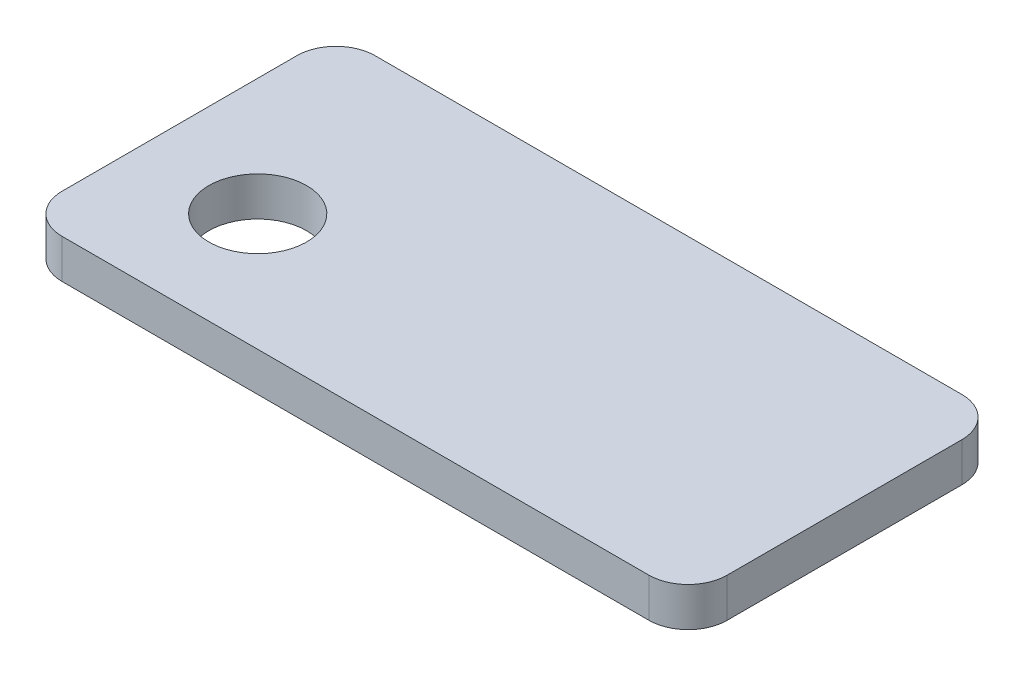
from build123d import *

# Parameters (mm, degrees)
ESQUISSE1_R        = 6.25
BOSS_EXTRU_1_DEPTH = 5


with BuildPart() as part:
    # Esquisse1 → Boss.-Extru.1 (new body)
    with BuildSketch(Plane(origin=(0, 2.5, 0), x_dir=(1, 0, 0), z_dir=(0, 1, 0))):
        with BuildLine():
            Line((-37.5, -20), (37.5, -20))
            ThreePointArc((37.5, -20), (41.035533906, -18.535533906), (42.5, -15))
            Line((42.5, -15), (42.5, 15))
            ThreePointArc((42.5, 15), (41.035533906, 18.535533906), (37.5, 20))
            Line((37.5, 20), (-37.5, 20))
            ThreePointArc((-37.5, 20), (-41.035533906, 18.535533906), (-42.5, 15))
            Line((-42.5, 15), (-42.5, -15))
            ThreePointArc((-42.5, -15), (-41.035533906, -18.535533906), (-37.5, -20))
        make_face()
        with Locations(Location((-27.5, -5, 0), (0, 0, 90))):
            Circle(ESQUISSE1_R, mode=Mode.SUBTRACT)
    extrude(amount=-BOSS_EXTRU_1_DEPTH)


solid = part.part
